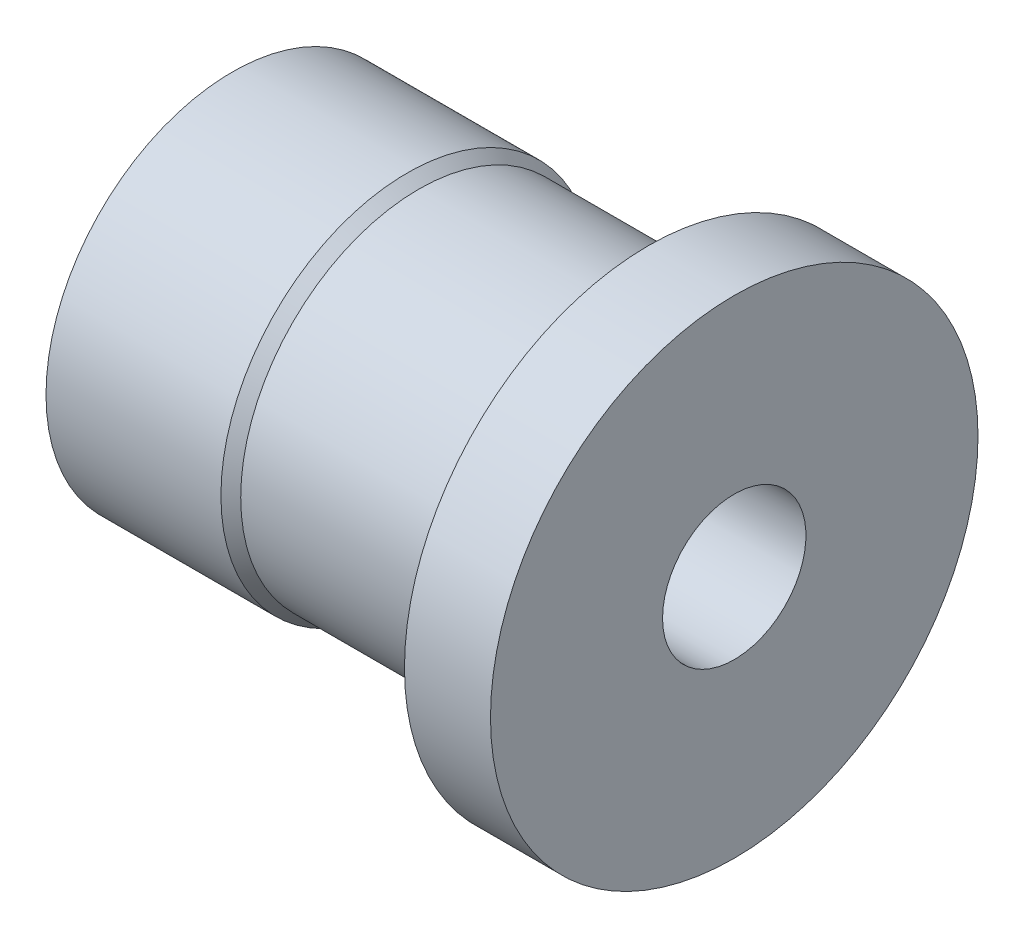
ISO-10303-21;
HEADER;
FILE_DESCRIPTION(('STEP AP214'),'2;1');
FILE_NAME('part.step','',(''),(''),'','','');
FILE_SCHEMA(('AUTOMOTIVE_DESIGN { 1 0 10303 214 1 1 1 1 }'));
ENDSEC;
DATA;
#1=APPLICATION_CONTEXT('core data for automotive mechanical design processes');
#2=APPLICATION_PROTOCOL_DEFINITION('international standard','automotive_design',2000,#1);
#3=PRODUCT_CONTEXT('',#1,'mechanical');
#4=PRODUCT('Part','Part','',(#3));
#5=PRODUCT_RELATED_PRODUCT_CATEGORY('part','',(#4));
#6=PRODUCT_DEFINITION_FORMATION('','',#4);
#7=PRODUCT_DEFINITION_CONTEXT('part definition',#1,'design');
#8=PRODUCT_DEFINITION('design','',#6,#7);
#9=PRODUCT_DEFINITION_SHAPE('','',#8);
#10=(LENGTH_UNIT() NAMED_UNIT(*) SI_UNIT(.MILLI.,.METRE.));
#11=(NAMED_UNIT(*) PLANE_ANGLE_UNIT() SI_UNIT($,.RADIAN.));
#12=(NAMED_UNIT(*) SI_UNIT($,.STERADIAN.) SOLID_ANGLE_UNIT());
#13=UNCERTAINTY_MEASURE_WITH_UNIT(LENGTH_MEASURE(1.E-05),#10,'distance_accuracy_value','');
#14=(GEOMETRIC_REPRESENTATION_CONTEXT(3) GLOBAL_UNCERTAINTY_ASSIGNED_CONTEXT((#13)) GLOBAL_UNIT_ASSIGNED_CONTEXT((#10,
#11,#12)) REPRESENTATION_CONTEXT('',''));
#15=CARTESIAN_POINT('',(0.,0.,0.));
#16=DIRECTION('',(0.,0.,1.));
#17=DIRECTION('',(1.,0.,0.));
#18=AXIS2_PLACEMENT_3D('',#15,#16,#17);
#19=CARTESIAN_POINT('',(-8.75,0.,-6.5));
#20=DIRECTION('',(1.,0.,0.));
#21=DIRECTION('',(0.,0.,-1.));
#22=AXIS2_PLACEMENT_3D('',#19,#20,#21);
#23=PLANE('',#22);
#24=CARTESIAN_POINT('',(-8.75,0.,0.));
#25=DIRECTION('',(-1.,0.,0.));
#26=DIRECTION('',(0.,0.,1.));
#27=AXIS2_PLACEMENT_3D('',#24,#25,#26);
#28=CIRCLE('',#27,2.5);
#29=CARTESIAN_POINT('',(-8.75,0.,2.5));
#30=VERTEX_POINT('',#29);
#31=EDGE_CURVE('E10',#30,#30,#28,.T.);
#32=ORIENTED_EDGE('',*,*,#31,.F.);
#33=EDGE_LOOP('',(#32));
#34=FACE_BOUND('',#33,.T.);
#35=CARTESIAN_POINT('',(-8.75,0.,0.));
#36=DIRECTION('',(-1.,0.,0.));
#37=DIRECTION('',(0.,0.,1.));
#38=AXIS2_PLACEMENT_3D('',#35,#36,#37);
#39=CIRCLE('',#38,6.5);
#40=CARTESIAN_POINT('',(-8.75,0.,6.5));
#41=VERTEX_POINT('',#40);
#42=EDGE_CURVE('E66',#41,#41,#39,.T.);
#43=ORIENTED_EDGE('',*,*,#42,.T.);
#44=EDGE_LOOP('',(#43));
#45=FACE_BOUND('',#44,.T.);
#46=ADVANCED_FACE('F34',(#34,#45),#23,.F.);
#47=CARTESIAN_POINT('',(-8.75,0.,0.));
#48=DIRECTION('',(-1.,0.,0.));
#49=DIRECTION('',(0.,0.,1.));
#50=AXIS2_PLACEMENT_3D('',#47,#48,#49);
#51=CYLINDRICAL_SURFACE('',#50,2.5);
#52=CARTESIAN_POINT('',(-5.75,-2.,1.5));
#53=CARTESIAN_POINT('',(-5.82547897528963,-1.99999416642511,1.50000404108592));
#54=CARTESIAN_POINT('',(-5.90093843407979,-2.00433633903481,1.49426852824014));
#55=CARTESIAN_POINT('',(-6.04932390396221,-2.02092590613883,1.47174965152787));
#56=CARTESIAN_POINT('',(-6.1222471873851,-2.03318155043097,1.45495475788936));
#57=CARTESIAN_POINT('',(-6.26308364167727,-2.0636233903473,1.41143486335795));
#58=CARTESIAN_POINT('',(-6.33102883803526,-2.08176666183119,1.3847815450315));
#59=CARTESIAN_POINT('',(-6.46143745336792,-2.12185904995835,1.32252909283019));
#60=CARTESIAN_POINT('',(-6.52389922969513,-2.14380930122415,1.28692729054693));
#61=CARTESIAN_POINT('',(-6.64994901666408,-2.19228594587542,1.20271292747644));
#62=CARTESIAN_POINT('',(-6.71274095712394,-2.21904371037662,1.15304179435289));
#63=CARTESIAN_POINT('',(-6.82976476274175,-2.2722622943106,1.04426801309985));
#64=CARTESIAN_POINT('',(-6.8839901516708,-2.29872287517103,0.985158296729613));
#65=CARTESIAN_POINT('',(-6.98813380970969,-2.35175567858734,0.851442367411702));
#66=CARTESIAN_POINT('',(-7.03695446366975,-2.37803133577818,0.775851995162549));
#67=CARTESIAN_POINT('',(-7.12080972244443,-2.42443786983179,0.615654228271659));
#68=CARTESIAN_POINT('',(-7.15585697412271,-2.44457437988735,0.531055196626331));
#69=CARTESIAN_POINT('',(-7.20759592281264,-2.4747098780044,0.363771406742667));
#70=CARTESIAN_POINT('',(-7.22572036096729,-2.4854930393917,0.281674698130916));
#71=CARTESIAN_POINT('',(-7.24794280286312,-2.49874939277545,0.114970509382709));
#72=CARTESIAN_POINT('',(-7.25205397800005,-2.50123038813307,0.030365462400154));
#73=CARTESIAN_POINT('',(-7.24638625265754,-2.49783372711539,-0.127637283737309));
#74=CARTESIAN_POINT('',(-7.23826647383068,-2.49295437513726,-0.201123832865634));
#75=CARTESIAN_POINT('',(-7.21152020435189,-2.47707997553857,-0.345464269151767));
#76=CARTESIAN_POINT('',(-7.19289293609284,-2.46608447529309,-0.416317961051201));
#77=CARTESIAN_POINT('',(-7.14583443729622,-2.43884907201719,-0.554056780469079));
#78=CARTESIAN_POINT('',(-7.117346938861,-2.42257910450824,-0.620916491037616));
#79=CARTESIAN_POINT('',(-7.05161538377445,-2.38609637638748,-0.74898866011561));
#80=CARTESIAN_POINT('',(-7.01436905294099,-2.36588259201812,-0.81019964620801));
#81=CARTESIAN_POINT('',(-6.92716090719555,-2.32037925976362,-0.933074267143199));
#82=CARTESIAN_POINT('',(-6.87621168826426,-2.2947718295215,-0.993918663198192));
#83=CARTESIAN_POINT('',(-6.76559588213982,-2.24255554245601,-1.10671465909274));
#84=CARTESIAN_POINT('',(-6.70591749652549,-2.21594536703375,-1.15865401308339));
#85=CARTESIAN_POINT('',(-6.57134659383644,-2.16111075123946,-1.25824837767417));
#86=CARTESIAN_POINT('',(-6.49549242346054,-2.13305661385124,-1.30470933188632));
#87=CARTESIAN_POINT('',(-6.33529376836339,-2.08250879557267,-1.38397217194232));
#88=CARTESIAN_POINT('',(-6.25096528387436,-2.0600049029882,-1.41679921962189));
#89=CARTESIAN_POINT('',(-6.09760636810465,-2.02895865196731,-1.46077497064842));
#90=CARTESIAN_POINT('',(-6.02995936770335,-2.01833888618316,-1.47527903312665));
#91=CARTESIAN_POINT('',(-5.89262638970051,-2.00392150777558,-1.49480872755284));
#92=CARTESIAN_POINT('',(-5.82294287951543,-2.00011596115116,-1.49984538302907));
#93=CARTESIAN_POINT('',(-5.68344831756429,-1.99988914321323,-1.50014781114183));
#94=CARTESIAN_POINT('',(-5.61363722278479,-2.00347810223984,-1.49540004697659));
#95=CARTESIAN_POINT('',(-5.47601265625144,-2.01751520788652,-1.47640290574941));
#96=CARTESIAN_POINT('',(-5.40820080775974,-2.02796877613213,-1.46214601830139));
#97=CARTESIAN_POINT('',(-5.27628542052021,-2.054317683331,-1.42488312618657));
#98=CARTESIAN_POINT('',(-5.21217736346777,-2.07020622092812,-1.40188805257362));
#99=CARTESIAN_POINT('',(-5.08852228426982,-2.10571539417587,-1.34796261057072));
#100=CARTESIAN_POINT('',(-5.02897699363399,-2.12533743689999,-1.31702924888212));
#101=CARTESIAN_POINT('',(-4.90475991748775,-2.17036819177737,-1.24167439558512));
#102=CARTESIAN_POINT('',(-4.84109916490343,-2.19618239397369,-1.19582663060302));
#103=CARTESIAN_POINT('',(-4.72171451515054,-2.2482175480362,-1.094873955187));
#104=CARTESIAN_POINT('',(-4.66599830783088,-2.27443886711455,-1.03976018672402));
#105=CARTESIAN_POINT('',(-4.55677599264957,-2.32835625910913,-0.913274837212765));
#106=CARTESIAN_POINT('',(-4.50449927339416,-2.3558007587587,-0.84072110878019));
#107=CARTESIAN_POINT('',(-4.41309722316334,-2.40537639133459,-0.686103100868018));
#108=CARTESIAN_POINT('',(-4.37396317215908,-2.4275110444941,-0.604045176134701));
#109=CARTESIAN_POINT('',(-4.31313179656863,-2.46252280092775,-0.438840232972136));
#110=CARTESIAN_POINT('',(-4.29037377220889,-2.47595588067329,-0.356205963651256));
#111=CARTESIAN_POINT('',(-4.25928539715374,-2.494407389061,-0.187383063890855));
#112=CARTESIAN_POINT('',(-4.25093870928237,-2.49943534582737,-0.101198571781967));
#113=CARTESIAN_POINT('',(-4.24932539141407,-2.50040600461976,0.0598120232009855));
#114=CARTESIAN_POINT('',(-4.25419666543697,-2.49747057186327,0.134620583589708));
#115=CARTESIAN_POINT('',(-4.27489382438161,-2.48512948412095,0.282148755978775));
#116=CARTESIAN_POINT('',(-4.29071983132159,-2.47572375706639,0.354868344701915));
#117=CARTESIAN_POINT('',(-4.33221957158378,-2.45149427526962,0.495145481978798));
#118=CARTESIAN_POINT('',(-4.35773159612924,-2.43675966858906,0.562767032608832));
#119=CARTESIAN_POINT('',(-4.41764059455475,-2.40303337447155,0.692781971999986));
#120=CARTESIAN_POINT('',(-4.4520395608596,-2.38404073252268,0.755174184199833));
#121=CARTESIAN_POINT('',(-4.53292519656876,-2.3409343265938,0.880263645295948));
#122=CARTESIAN_POINT('',(-4.58031870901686,-2.31648844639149,0.942258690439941));
#123=CARTESIAN_POINT('',(-4.68375303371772,-2.26601907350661,1.05789751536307));
#124=CARTESIAN_POINT('',(-4.73980342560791,-2.23999385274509,1.11153190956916));
#125=CARTESIAN_POINT('',(-4.8672855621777,-2.18528165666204,1.2159097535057));
#126=CARTESIAN_POINT('',(-4.9397664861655,-2.15667566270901,1.26542406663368));
#127=CARTESIAN_POINT('',(-5.09348485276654,-2.10376464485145,1.35156817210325));
#128=CARTESIAN_POINT('',(-5.17471771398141,-2.07945738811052,1.38820466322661));
#129=CARTESIAN_POINT('',(-5.3370642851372,-2.0408000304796,1.44437116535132));
#130=CARTESIAN_POINT('',(-5.41759523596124,-2.02577665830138,1.46509526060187));
#131=CARTESIAN_POINT('',(-5.58209739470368,-2.00539032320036,1.49289268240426));
#132=CARTESIAN_POINT('',(-5.66606076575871,-2.00000648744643,1.49999550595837));
#133=CARTESIAN_POINT('',(-5.75,-2.,1.5));
#134=B_SPLINE_CURVE_WITH_KNOTS('',3,(#52,#53,#54,#55,#56,#57,#58,#59,#60,#61,#62,#63,#64,#65,
#66,#67,#68,#69,#70,#71,#72,#73,#74,#75,#76,#77,#78,#79,#80,#81,#82,#83,#84,#85,#86,#87,#88,#89,
#90,#91,#92,#93,#94,#95,#96,#97,#98,#99,#100,#101,#102,#103,#104,#105,#106,#107,#108,#109,#110,
#111,#112,#113,#114,#115,#116,#117,#118,#119,#120,#121,#122,#123,#124,#125,#126,#127,#128,#129,
#130,#131,#132,#133),.UNSPECIFIED.,.T.,.F.,(4,2,2,2,2,2,2,2,2,2,2,2,2,2,2,2,2,2,2,2,2,2,2,2,2,2,
2,2,2,2,2,2,2,2,2,2,2,2,2,2,4),(0.,0.226085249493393,0.45240657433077,0.677113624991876,
0.901887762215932,1.15414462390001,1.40659128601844,1.68630157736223,1.9657544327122,
2.21853330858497,2.47107452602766,2.69230130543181,2.91354445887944,3.13607155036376,
3.35865648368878,3.60782810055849,3.85733966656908,4.13576671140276,4.41367760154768,
4.62276298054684,4.83160475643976,5.04073566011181,5.25003193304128,5.45906724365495,
5.6681814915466,5.91499438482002,6.16204457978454,6.44121828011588,6.72020638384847,
6.97891479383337,7.23732973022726,7.46129321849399,7.68525920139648,7.90563970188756,
8.12606965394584,8.37042963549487,8.61506198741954,8.89071695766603,9.16622832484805,
9.41820120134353,9.66962780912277),.UNSPECIFIED.);
#135=CARTESIAN_POINT('',(-5.75,-2.,1.5));
#136=VERTEX_POINT('',#135);
#137=EDGE_CURVE('E69',#136,#136,#134,.T.);
#138=ORIENTED_EDGE('',*,*,#137,.T.);
#139=EDGE_LOOP('',(#138));
#140=FACE_BOUND('',#139,.T.);
#141=CARTESIAN_POINT('',(8.75,0.,0.));
#142=DIRECTION('',(-1.,0.,0.));
#143=DIRECTION('',(0.,0.,1.));
#144=AXIS2_PLACEMENT_3D('',#141,#142,#143);
#145=CIRCLE('',#144,2.5);
#146=CARTESIAN_POINT('',(8.75,0.,2.49999999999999));
#147=VERTEX_POINT('',#146);
#148=EDGE_CURVE('E45',#147,#147,#145,.T.);
#149=ORIENTED_EDGE('',*,*,#148,.F.);
#150=EDGE_LOOP('',(#149));
#151=FACE_BOUND('',#150,.T.);
#152=ORIENTED_EDGE('',*,*,#31,.T.);
#153=EDGE_LOOP('',(#152));
#154=FACE_BOUND('',#153,.T.);
#155=ADVANCED_FACE('F73',(#140,#151,#154),#51,.F.);
#156=CARTESIAN_POINT('',(8.75,0.,-2.5));
#157=DIRECTION('',(-1.,0.,0.));
#158=DIRECTION('',(0.,0.,1.));
#159=AXIS2_PLACEMENT_3D('',#156,#157,#158);
#160=PLANE('',#159);
#161=CARTESIAN_POINT('',(8.75,0.,0.));
#162=DIRECTION('',(-1.,0.,0.));
#163=DIRECTION('',(0.,0.,1.));
#164=AXIS2_PLACEMENT_3D('',#161,#162,#163);
#165=CIRCLE('',#164,8.5);
#166=CARTESIAN_POINT('',(8.75,0.,8.49999999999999));
#167=VERTEX_POINT('',#166);
#168=EDGE_CURVE('E49',#167,#167,#165,.T.);
#169=ORIENTED_EDGE('',*,*,#168,.F.);
#170=EDGE_LOOP('',(#169));
#171=FACE_BOUND('',#170,.T.);
#172=ORIENTED_EDGE('',*,*,#148,.T.);
#173=EDGE_LOOP('',(#172));
#174=FACE_BOUND('',#173,.T.);
#175=ADVANCED_FACE('F100',(#171,#174),#160,.F.);
#176=CARTESIAN_POINT('',(-8.75,0.,0.));
#177=DIRECTION('',(-1.,0.,0.));
#178=DIRECTION('',(0.,0.,1.));
#179=AXIS2_PLACEMENT_3D('',#176,#177,#178);
#180=CYLINDRICAL_SURFACE('',#179,8.5);
#181=CARTESIAN_POINT('',(5.75,0.,0.));
#182=DIRECTION('',(-1.,0.,0.));
#183=DIRECTION('',(0.,0.,1.));
#184=AXIS2_PLACEMENT_3D('',#181,#182,#183);
#185=CIRCLE('',#184,8.5);
#186=CARTESIAN_POINT('',(5.75000000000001,0.,8.49999999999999));
#187=VERTEX_POINT('',#186);
#188=EDGE_CURVE('E54',#187,#187,#185,.T.);
#189=ORIENTED_EDGE('',*,*,#188,.F.);
#190=EDGE_LOOP('',(#189));
#191=FACE_BOUND('',#190,.T.);
#192=ORIENTED_EDGE('',*,*,#168,.T.);
#193=EDGE_LOOP('',(#192));
#194=FACE_BOUND('',#193,.T.);
#195=ADVANCED_FACE('F97',(#191,#194),#180,.T.);
#196=CARTESIAN_POINT('',(5.75,0.,-8.5));
#197=DIRECTION('',(1.,0.,0.));
#198=DIRECTION('',(0.,0.,-1.));
#199=AXIS2_PLACEMENT_3D('',#196,#197,#198);
#200=PLANE('',#199);
#201=CARTESIAN_POINT('',(5.75,0.,0.));
#202=DIRECTION('',(-1.,0.,0.));
#203=DIRECTION('',(0.,0.,1.));
#204=AXIS2_PLACEMENT_3D('',#201,#202,#203);
#205=CIRCLE('',#204,6.21);
#206=CARTESIAN_POINT('',(5.75,0.,6.20999999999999));
#207=VERTEX_POINT('',#206);
#208=EDGE_CURVE('E57',#207,#207,#205,.T.);
#209=ORIENTED_EDGE('',*,*,#208,.F.);
#210=EDGE_LOOP('',(#209));
#211=FACE_BOUND('',#210,.T.);
#212=ORIENTED_EDGE('',*,*,#188,.T.);
#213=EDGE_LOOP('',(#212));
#214=FACE_BOUND('',#213,.T.);
#215=ADVANCED_FACE('F93',(#211,#214),#200,.F.);
#216=CARTESIAN_POINT('',(-8.75,0.,0.));
#217=DIRECTION('',(-1.,0.,0.));
#218=DIRECTION('',(0.,0.,1.));
#219=AXIS2_PLACEMENT_3D('',#216,#217,#218);
#220=CYLINDRICAL_SURFACE('',#219,6.21);
#221=CARTESIAN_POINT('',(-2.25,0.,0.));
#222=DIRECTION('',(-1.,0.,0.));
#223=DIRECTION('',(0.,0.,1.));
#224=AXIS2_PLACEMENT_3D('',#221,#222,#223);
#225=CIRCLE('',#224,6.21);
#226=CARTESIAN_POINT('',(-2.25,0.,6.21));
#227=VERTEX_POINT('',#226);
#228=EDGE_CURVE('E60',#227,#227,#225,.T.);
#229=ORIENTED_EDGE('',*,*,#228,.F.);
#230=EDGE_LOOP('',(#229));
#231=FACE_BOUND('',#230,.T.);
#232=ORIENTED_EDGE('',*,*,#208,.T.);
#233=EDGE_LOOP('',(#232));
#234=FACE_BOUND('',#233,.T.);
#235=ADVANCED_FACE('F89',(#231,#234),#220,.T.);
#236=CARTESIAN_POINT('',(-2.25,0.,0.));
#237=DIRECTION('',(-1.,0.,0.));
#238=DIRECTION('',(0.,0.,1.));
#239=AXIS2_PLACEMENT_3D('',#236,#237,#238);
#240=CONICAL_SURFACE('',#239,6.21,0.626674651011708);
#241=CARTESIAN_POINT('',(-2.65053373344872,0.,0.));
#242=DIRECTION('',(-1.,0.,0.));
#243=DIRECTION('',(0.,0.,1.));
#244=AXIS2_PLACEMENT_3D('',#241,#242,#243);
#245=CIRCLE('',#244,6.5);
#246=CARTESIAN_POINT('',(-2.65053373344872,0.,6.5));
#247=VERTEX_POINT('',#246);
#248=EDGE_CURVE('E63',#247,#247,#245,.T.);
#249=ORIENTED_EDGE('',*,*,#248,.F.);
#250=EDGE_LOOP('',(#249));
#251=FACE_BOUND('',#250,.T.);
#252=ORIENTED_EDGE('',*,*,#228,.T.);
#253=EDGE_LOOP('',(#252));
#254=FACE_BOUND('',#253,.T.);
#255=ADVANCED_FACE('F85',(#251,#254),#240,.T.);
#256=CARTESIAN_POINT('',(-8.75,0.,0.));
#257=DIRECTION('',(-1.,0.,0.));
#258=DIRECTION('',(0.,0.,1.));
#259=AXIS2_PLACEMENT_3D('',#256,#257,#258);
#260=CYLINDRICAL_SURFACE('',#259,6.5);
#261=CARTESIAN_POINT('',(-5.75,-6.32455532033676,1.5));
#262=CARTESIAN_POINT('',(-5.66695703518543,-6.32455698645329,1.49999731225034));
#263=CARTESIAN_POINT('',(-5.58388275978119,-6.32620871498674,1.49308039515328));
#264=CARTESIAN_POINT('',(-5.42010523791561,-6.33262329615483,1.46563082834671));
#265=CARTESIAN_POINT('',(-5.33940361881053,-6.33738823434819,1.44508905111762));
#266=CARTESIAN_POINT('',(-5.18276408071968,-6.34946149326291,1.39107808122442));
#267=CARTESIAN_POINT('',(-5.10682071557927,-6.35676684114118,1.3576239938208));
#268=CARTESIAN_POINT('',(-4.96162019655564,-6.37309417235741,1.27878238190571));
#269=CARTESIAN_POINT('',(-4.89236306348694,-6.3821161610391,1.23339482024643));
#270=CARTESIAN_POINT('',(-4.76119977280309,-6.40104967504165,1.13106531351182));
#271=CARTESIAN_POINT('',(-4.69943756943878,-6.41097365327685,1.0739411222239));
#272=CARTESIAN_POINT('',(-4.58628085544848,-6.43048432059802,0.950153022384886));
#273=CARTESIAN_POINT('',(-4.53488720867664,-6.44007098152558,0.883488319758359));
#274=CARTESIAN_POINT('',(-4.44334977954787,-6.45796329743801,0.741538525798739));
#275=CARTESIAN_POINT('',(-4.40334556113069,-6.46625254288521,0.666161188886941));
#276=CARTESIAN_POINT('',(-4.33662714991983,-6.4804748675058,0.509529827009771));
#277=CARTESIAN_POINT('',(-4.3099112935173,-6.48640824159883,0.428276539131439));
#278=CARTESIAN_POINT('',(-4.27098383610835,-6.49516228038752,0.263698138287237));
#279=CARTESIAN_POINT('',(-4.25852827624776,-6.49803523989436,0.180433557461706));
#280=CARTESIAN_POINT('',(-4.24771110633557,-6.50052632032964,0.012950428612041));
#281=CARTESIAN_POINT('',(-4.24934770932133,-6.50014485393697,-0.07126799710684));
#282=CARTESIAN_POINT('',(-4.26648901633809,-6.49620964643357,-0.236582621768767));
#283=CARTESIAN_POINT('',(-4.2817306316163,-6.49271608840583,-0.317707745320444));
#284=CARTESIAN_POINT('',(-4.32522872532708,-6.48301834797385,-0.476216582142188));
#285=CARTESIAN_POINT('',(-4.35348583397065,-6.47681403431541,-0.553600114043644));
#286=CARTESIAN_POINT('',(-4.42243807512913,-6.46229685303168,-0.703145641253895));
#287=CARTESIAN_POINT('',(-4.46323065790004,-6.45396755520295,-0.775261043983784));
#288=CARTESIAN_POINT('',(-4.5560227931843,-6.43611015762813,-0.911717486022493));
#289=CARTESIAN_POINT('',(-4.608024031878,-6.42658187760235,-0.976057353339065));
#290=CARTESIAN_POINT('',(-4.72318175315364,-6.40711077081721,-1.09670294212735));
#291=CARTESIAN_POINT('',(-4.78656841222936,-6.39716345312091,-1.15278844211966));
#292=CARTESIAN_POINT('',(-4.92195123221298,-6.37818005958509,-1.25357772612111));
#293=CARTESIAN_POINT('',(-4.99394768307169,-6.36914401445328,-1.29828112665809));
#294=CARTESIAN_POINT('',(-5.14489025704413,-6.35299268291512,-1.37515073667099));
#295=CARTESIAN_POINT('',(-5.22386050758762,-6.34588444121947,-1.40727114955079));
#296=CARTESIAN_POINT('',(-5.38628177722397,-6.33448805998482,-1.45771632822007));
#297=CARTESIAN_POINT('',(-5.46973199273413,-6.3301994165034,-1.47604355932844));
#298=CARTESIAN_POINT('',(-5.63672092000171,-6.3250317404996,-1.49803182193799));
#299=CARTESIAN_POINT('',(-5.72021489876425,-6.32407774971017,-1.5020153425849));
#300=CARTESIAN_POINT('',(-5.88667403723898,-6.32548450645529,-1.49607984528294));
#301=CARTESIAN_POINT('',(-5.96963923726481,-6.32784499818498,-1.48616190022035));
#302=CARTESIAN_POINT('',(-6.13153554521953,-6.33554357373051,-1.45298594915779));
#303=CARTESIAN_POINT('',(-6.21050591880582,-6.34084115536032,-1.42990927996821));
#304=CARTESIAN_POINT('',(-6.36345878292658,-6.35377976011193,-1.37126901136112));
#305=CARTESIAN_POINT('',(-6.43744075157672,-6.36142102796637,-1.33570410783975));
#306=CARTESIAN_POINT('',(-6.57970153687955,-6.3783481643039,-1.25239967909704));
#307=CARTESIAN_POINT('',(-6.64786216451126,-6.38765975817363,-1.20446365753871));
#308=CARTESIAN_POINT('',(-6.77529036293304,-6.40681231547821,-1.09803158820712));
#309=CARTESIAN_POINT('',(-6.83455669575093,-6.41665335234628,-1.03953407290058));
#310=CARTESIAN_POINT('',(-6.94378581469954,-6.43600563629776,-0.912172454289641));
#311=CARTESIAN_POINT('',(-6.9935275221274,-6.44550564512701,-0.843116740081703));
#312=CARTESIAN_POINT('',(-7.08070540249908,-6.46288988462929,-0.697443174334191));
#313=CARTESIAN_POINT('',(-7.11814218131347,-6.47077419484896,-0.620825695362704));
#314=CARTESIAN_POINT('',(-7.17934973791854,-6.48399176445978,-0.462705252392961));
#315=CARTESIAN_POINT('',(-7.20321220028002,-6.48934209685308,-0.381239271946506));
#316=CARTESIAN_POINT('',(-7.23687651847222,-6.49696306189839,-0.215316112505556));
#317=CARTESIAN_POINT('',(-7.24668066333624,-6.4992341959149,-0.130859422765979));
#318=CARTESIAN_POINT('',(-7.25183745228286,-6.5004239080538,0.0365573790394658));
#319=CARTESIAN_POINT('',(-7.24751869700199,-6.49941871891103,0.11950699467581));
#320=CARTESIAN_POINT('',(-7.2252938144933,-6.49433417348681,0.283464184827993));
#321=CARTESIAN_POINT('',(-7.207387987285,-6.49025488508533,0.364471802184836));
#322=CARTESIAN_POINT('',(-7.15866201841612,-6.47948846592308,0.521957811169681));
#323=CARTESIAN_POINT('',(-7.12789328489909,-6.47281172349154,0.598452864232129));
#324=CARTESIAN_POINT('',(-7.05436331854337,-6.4575595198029,0.745235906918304));
#325=CARTESIAN_POINT('',(-7.01160078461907,-6.448983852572,0.815523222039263));
#326=CARTESIAN_POINT('',(-6.91425124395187,-6.43064181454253,0.949482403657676));
#327=CARTESIAN_POINT('',(-6.85943607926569,-6.42085432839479,1.01298558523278));
#328=CARTESIAN_POINT('',(-6.73999121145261,-6.40129818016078,1.13000416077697));
#329=CARTESIAN_POINT('',(-6.6753591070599,-6.3915295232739,1.1835171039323));
#330=CARTESIAN_POINT('',(-6.53692801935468,-6.37294956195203,1.27982908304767));
#331=CARTESIAN_POINT('',(-6.46300419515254,-6.36415514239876,1.32245215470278));
#332=CARTESIAN_POINT('',(-6.30885215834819,-6.34873668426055,1.39460165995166));
#333=CARTESIAN_POINT('',(-6.22862907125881,-6.34211090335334,1.42413861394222));
#334=CARTESIAN_POINT('',(-6.08200088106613,-6.332935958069,1.46432382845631));
#335=CARTESIAN_POINT('',(-6.01635913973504,-6.32981507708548,1.47767548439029));
#336=CARTESIAN_POINT('',(-5.88381832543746,-6.32562414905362,1.49551438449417));
#337=CARTESIAN_POINT('',(-5.81691932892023,-6.32455397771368,1.50000216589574));
#338=CARTESIAN_POINT('',(-5.75,-6.32455532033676,1.5));
#339=B_SPLINE_CURVE_WITH_KNOTS('',3,(#261,#262,#263,#264,#265,#266,#267,#268,#269,#270,#271,
#272,#273,#274,#275,#276,#277,#278,#279,#280,#281,#282,#283,#284,#285,#286,#287,#288,#289,#290,
#291,#292,#293,#294,#295,#296,#297,#298,#299,#300,#301,#302,#303,#304,#305,#306,#307,#308,#309,
#310,#311,#312,#313,#314,#315,#316,#317,#318,#319,#320,#321,#322,#323,#324,#325,#326,#327,#328,
#329,#330,#331,#332,#333,#334,#335,#336,#337,#338),.UNSPECIFIED.,.T.,.F.,(4,2,2,2,2,2,2,2,2,2,2,
2,2,2,2,2,2,2,2,2,2,2,2,2,2,2,2,2,2,2,2,2,2,2,2,2,2,2,4),(0.,0.248883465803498,
0.497933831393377,0.746693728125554,0.995454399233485,1.24841764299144,1.50140195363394,
1.75736456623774,2.01329512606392,2.26477865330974,2.5162302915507,2.7629223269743,
3.00962630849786,3.25829886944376,3.50700886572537,3.76147084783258,4.01594140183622,
4.27132969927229,4.52667233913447,4.77623696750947,5.02578233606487,5.27196914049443,
5.51818166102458,5.7685754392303,6.01900403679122,6.27468245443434,6.53034828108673,
6.78426611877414,7.03814260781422,7.28615450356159,7.53416092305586,7.78118549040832,
8.02823686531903,8.2804443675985,8.53271366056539,8.78883275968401,9.04474558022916,
9.24531794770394,9.44587815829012),.UNSPECIFIED.);
#340=CARTESIAN_POINT('',(-5.75,-6.32455532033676,1.5));
#341=VERTEX_POINT('',#340);
#342=EDGE_CURVE('E37',#341,#341,#339,.T.);
#343=ORIENTED_EDGE('',*,*,#342,.T.);
#344=EDGE_LOOP('',(#343));
#345=FACE_BOUND('',#344,.T.);
#346=ORIENTED_EDGE('',*,*,#42,.F.);
#347=EDGE_LOOP('',(#346));
#348=FACE_BOUND('',#347,.T.);
#349=ORIENTED_EDGE('',*,*,#248,.T.);
#350=EDGE_LOOP('',(#349));
#351=FACE_BOUND('',#350,.T.);
#352=ADVANCED_FACE('F79',(#345,#348,#351),#260,.T.);
#353=CARTESIAN_POINT('',(-5.75,-10.,0.));
#354=DIRECTION('',(0.,1.,0.));
#355=DIRECTION('',(0.,0.,1.));
#356=AXIS2_PLACEMENT_3D('',#353,#354,#355);
#357=CYLINDRICAL_SURFACE('',#356,1.5);
#358=ORIENTED_EDGE('',*,*,#342,.F.);
#359=EDGE_LOOP('',(#358));
#360=FACE_BOUND('',#359,.T.);
#361=ORIENTED_EDGE('',*,*,#137,.F.);
#362=EDGE_LOOP('',(#361));
#363=FACE_BOUND('',#362,.T.);
#364=ADVANCED_FACE('F76',(#360,#363),#357,.F.);
#365=CLOSED_SHELL('',(#46,#155,#175,#195,#215,#235,#255,#352,#364));
#366=MANIFOLD_SOLID_BREP('B2',#365);
#367=ADVANCED_BREP_SHAPE_REPRESENTATION('',(#18,#366),#14);
#368=SHAPE_DEFINITION_REPRESENTATION(#9,#367);
ENDSEC;
END-ISO-10303-21;
